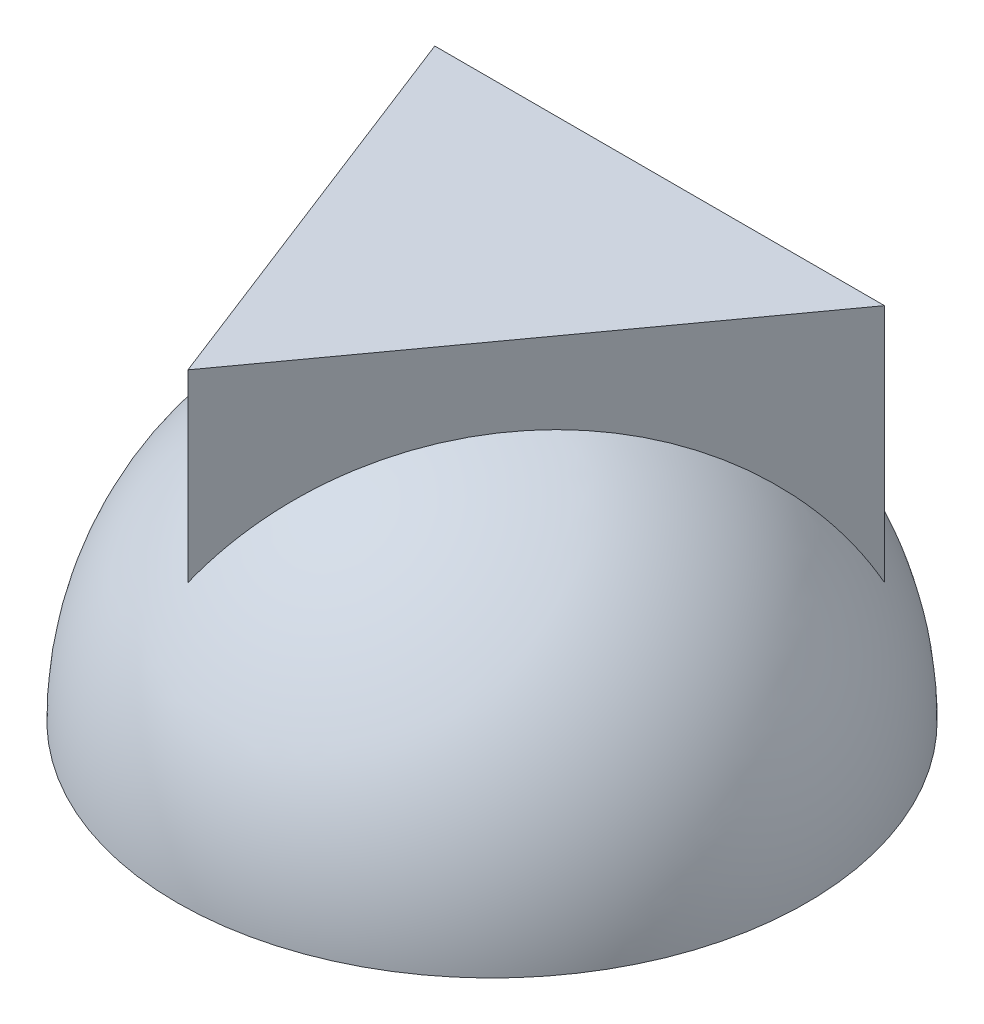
from build123d import *

# Parameters (mm, degrees)
REVOLVE_1_ANGLE = 180
EXTRUDE_1_DEPTH = 47


with BuildPart() as part:
    # Sketch 1 → Revolve 1 (revolve)
    with BuildSketch(Plane(origin=(0, 0, 0), x_dir=(1, 0, 0), z_dir=(0, 1, 0))):
        with BuildLine():
            Line((0, 38.5), (0, -38.5))
            ThreePointArc((0, -38.5), (38.5, 0), (0, 38.5))
        make_face()
    revolve(axis=Axis((0, 0, -38.5), (0, 0, 1)), revolution_arc=REVOLVE_1_ANGLE)

    # Sketch 2 → Extrude 1 (add)
    with BuildSketch(Plane(origin=(0, 0, 0), x_dir=(1, 0, 0), z_dir=(0, 1, 0))):
        Polygon((-28, 21), (-8.790909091, -28.396465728), (27, 21), align=None)
    extrude(amount=EXTRUDE_1_DEPTH)


solid = part.part
